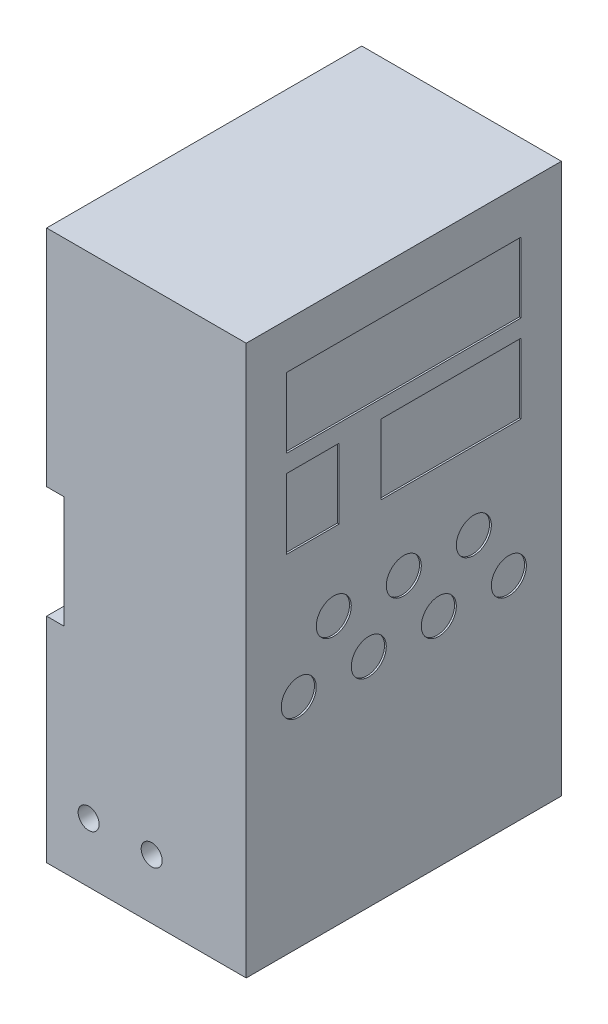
from build123d import *

# Parameters (mm, degrees)
EXTRUDE_1_DEPTH     = 90
SKETCH_2_R          = 3
CUT_EXTRUDE_1_DEPTH = 70
SKETCH_3_W          = 67
SKETCH_3_H          = 20
CUT_EXTRUDE_2_DEPTH = 0.5
SKETCH_4_R          = 5
SKETCH_4_W          = 15
SKETCH_4_H          = 20
SKETCH_4_W_2        = 40
CUT_EXTRUDE_3_DEPTH = 0.5


with BuildPart() as part:
    # Sketch 1 → Extrude 1 (new body)
    with BuildSketch(Plane.XY):
        Polygon((0, 93), (5, 93), (5, 61), (0, 61), (0, 0), (57, 0), (57, 157), (0, 157), align=None)
    extrude(amount=EXTRUDE_1_DEPTH)

    # Sketch 2 → Cut-Extrude 1 (cut)
    with BuildSketch(Plane.XY.offset(90)):
        with Locations((12, 17)):
            Circle(SKETCH_2_R)
        with Locations((30, 17)):
            Circle(SKETCH_2_R)
    extrude(amount=-CUT_EXTRUDE_1_DEPTH, mode=Mode.SUBTRACT)

    # Sketch 3 → Cut-Extrude 2 (cut)
    with BuildSketch(Plane(origin=(57, 0, 0), x_dir=(0, 0, -1), z_dir=(1, 0, 0))):
        with Locations((-45, 134)):
            Rectangle(SKETCH_3_W, SKETCH_3_H)
    extrude(amount=-CUT_EXTRUDE_2_DEPTH, mode=Mode.SUBTRACT)

    # Sketch 4 → Cut-Extrude 3 (cut)
    with BuildSketch(Plane(origin=(57, 0, 0), x_dir=(0, 0, -1), z_dir=(1, 0, 0))):
        with Locations(Location((-45, 77, 0), (0, 0, 90))):
            Circle(SKETCH_4_R)
        with Locations(Location((-25, 77, 0), (0, 0, 90))):
            Circle(SKETCH_4_R)
        with Locations(Location((-65, 77, 0), (0, 0, 270))):
            Circle(SKETCH_4_R)
        with Locations(Location((-35, 62, 0), (0, 0, 90))):
            Circle(SKETCH_4_R)
        with Locations(Location((-15, 62, 0), (0, 0, 90))):
            Circle(SKETCH_4_R)
        with Locations(Location((-55, 62, 0), (0, 0, 270))):
            Circle(SKETCH_4_R)
        with Locations(Location((-75, 62, 0), (0, 0, 270))):
            Circle(SKETCH_4_R)
        with Locations((-71, 109)):
            Rectangle(SKETCH_4_W, SKETCH_4_H)
        with Locations((-31.5, 109)):
            Rectangle(SKETCH_4_W_2, SKETCH_4_H)
    extrude(amount=-CUT_EXTRUDE_3_DEPTH, mode=Mode.SUBTRACT)


solid = part.part
